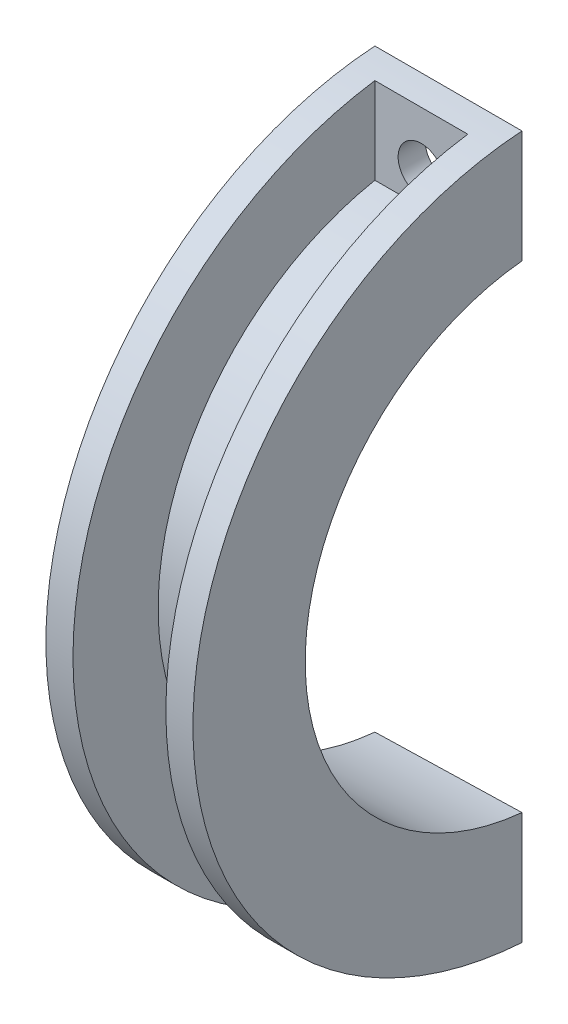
from build123d import *

# Parameters (mm, degrees)
BASE_R_VOLUTION_ANGLE           = 180
ENL_V_DE_MAT_EXTRU_MINCE1_DEPTH = 6
ESQUISSE5_R                     = 3
ENL_V_MAT_EXTRU_2_DEPTH         = 582.6470132
ESQUISSE6_R                     = 1.5
ENL_V_MAT_EXTRU_3_DEPTH         = 33
ENL_V_MAT_EXTRU_5_DEPTH         = 70.162851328
ENL_V_MAT_EXTRU_5_DEPTH_BACK    = 70.162851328


with BuildPart() as part:
    # Esquisse2 → Base-R_volution (revolve)
    with BuildSketch(Plane.XY.offset(3)):
        Polygon((578.076766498, 31), (578.076766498, 45.5), (559.076766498, 45.5), (559.076766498, 31.49753251), align=None)
    revolve(axis=Axis((589.521731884, 0, 3), (1, 0, 0)), revolution_arc=BASE_R_VOLUTION_ANGLE)

    # Esquisse3 → Enl_v. de mat.-Extru.-Mince1 (cut, symmetric)
    with BuildSketch(Plane.ZY.offset(-568.576766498)):
        with BuildLine():
            Line((9.5, 45.033320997), (9.5, 33.882148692))
            ThreePointArc((9.5, 33.882148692), (37.5, 0), (9.5, -33.882148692))
            Line((9.5, -33.882148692), (9.5, -45.033320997))
            Line((9.5, -45.033320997), (21.5, -45.033320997))
            Line((21.5, -45.033320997), (21.5, -42.661458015))
            ThreePointArc((21.5, -42.661458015), (49.5, 0), (21.5, 42.661458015))
            Line((21.5, 42.661458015), (21.5, 45.033320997))
            Line((21.5, 45.033320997), (9.5, 45.033320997))
        make_face()
    extrude(amount=ENL_V_DE_MAT_EXTRU_MINCE1_DEPTH, both=True, mode=Mode.SUBTRACT)

    # Esquisse5 → Enl_v. mat.-Extru.2 (cut, through all)
    with BuildSketch(Plane(origin=(0, 0, 3), x_dir=(-1, 0, 0), z_dir=(0, 0, -1))):
        with Locations(Location((-568.576766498, 38, 0), (0, 0, 270))):
            Circle(ESQUISSE5_R)
        with Locations(Location((-568.576766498, -38, 0), (0, 0, 270))):
            Circle(ESQUISSE5_R)
    extrude(amount=-ENL_V_MAT_EXTRU_2_DEPTH, mode=Mode.SUBTRACT)

    # Esquisse6 → Enl_v. mat.-Extru.3 (cut)
    with BuildSketch(Plane(origin=(0, 0, 3), x_dir=(-1, 0, 0), z_dir=(0, 0, -1))):
        with Locations(Location((-563.576766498, 0, 0), (0, 0, 90))):
            Circle(ESQUISSE6_R)
    extrude(amount=-ENL_V_MAT_EXTRU_3_DEPTH, mode=Mode.SUBTRACT)

    # Esquisse7 → Enl_v. mat.-Extru.5 (cut, two sides: drawn at the far end of the back side and taken through both)
    with BuildSketch(Plane.ZY.offset(-559.076766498).offset(-ENL_V_MAT_EXTRU_5_DEPTH_BACK)):
        Polygon((6, 269.059800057), (6, 50), (6, -50), (6, -269.059800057), (-432.119600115, -269.059800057), (-432.119600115, 269.059800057), align=None)
    extrude(amount=ENL_V_MAT_EXTRU_5_DEPTH + ENL_V_MAT_EXTRU_5_DEPTH_BACK, mode=Mode.SUBTRACT)


solid = part.part
